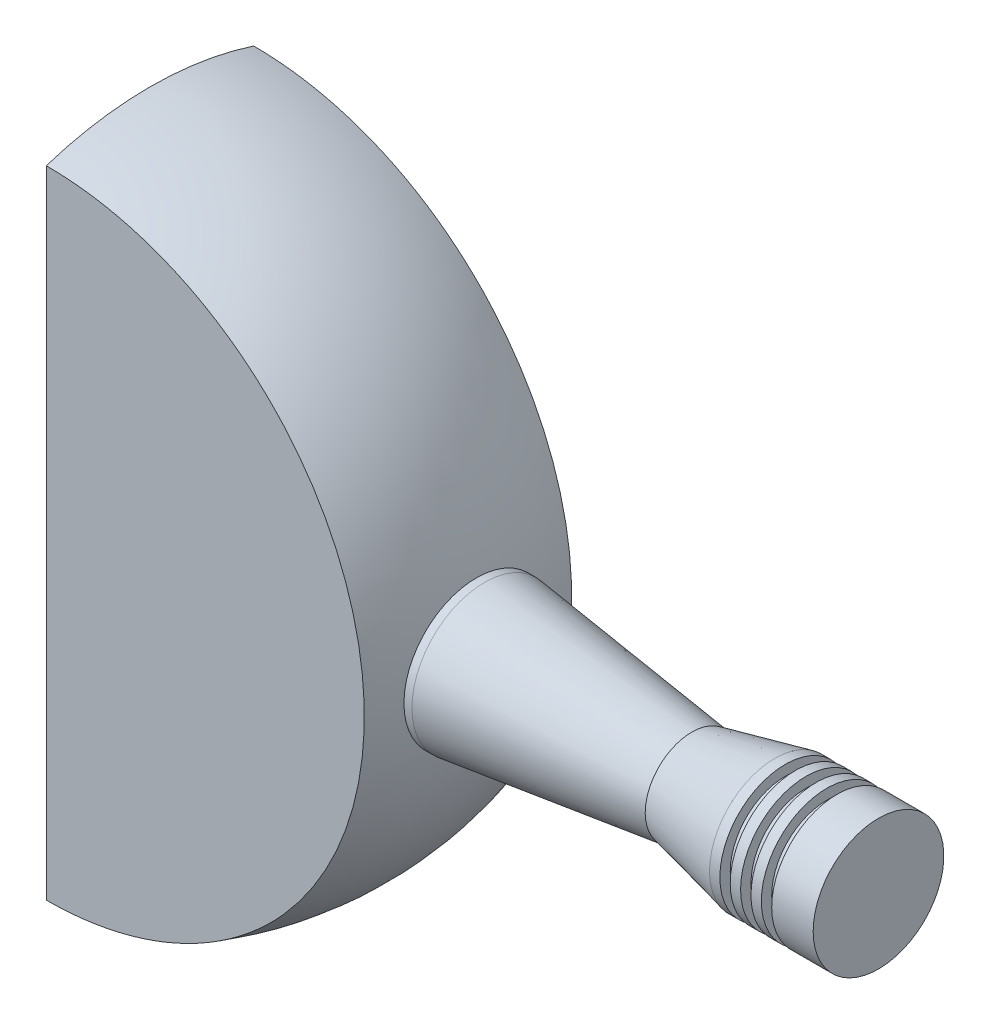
ISO-10303-21;
HEADER;
FILE_DESCRIPTION(('STEP AP214'),'2;1');
FILE_NAME('part.step','',(''),(''),'','','');
FILE_SCHEMA(('AUTOMOTIVE_DESIGN { 1 0 10303 214 1 1 1 1 }'));
ENDSEC;
DATA;
#1=APPLICATION_CONTEXT('core data for automotive mechanical design processes');
#2=APPLICATION_PROTOCOL_DEFINITION('international standard','automotive_design',2000,#1);
#3=PRODUCT_CONTEXT('',#1,'mechanical');
#4=PRODUCT('Part','Part','',(#3));
#5=PRODUCT_RELATED_PRODUCT_CATEGORY('part','',(#4));
#6=PRODUCT_DEFINITION_FORMATION('','',#4);
#7=PRODUCT_DEFINITION_CONTEXT('part definition',#1,'design');
#8=PRODUCT_DEFINITION('design','',#6,#7);
#9=PRODUCT_DEFINITION_SHAPE('','',#8);
#10=(LENGTH_UNIT() NAMED_UNIT(*) SI_UNIT(.MILLI.,.METRE.));
#11=(NAMED_UNIT(*) PLANE_ANGLE_UNIT() SI_UNIT($,.RADIAN.));
#12=(NAMED_UNIT(*) SI_UNIT($,.STERADIAN.) SOLID_ANGLE_UNIT());
#13=UNCERTAINTY_MEASURE_WITH_UNIT(LENGTH_MEASURE(1.E-05),#10,'distance_accuracy_value','');
#14=(GEOMETRIC_REPRESENTATION_CONTEXT(3) GLOBAL_UNCERTAINTY_ASSIGNED_CONTEXT((#13)) GLOBAL_UNIT_ASSIGNED_CONTEXT((#10,
#11,#12)) REPRESENTATION_CONTEXT('',''));
#15=CARTESIAN_POINT('',(0.,0.,0.));
#16=DIRECTION('',(0.,0.,1.));
#17=DIRECTION('',(1.,0.,0.));
#18=AXIS2_PLACEMENT_3D('',#15,#16,#17);
#19=CARTESIAN_POINT('',(0.,0.,0.));
#20=DIRECTION('',(0.,1.,0.));
#21=DIRECTION('',(1.,0.,0.));
#22=AXIS2_PLACEMENT_3D('',#19,#20,#21);
#23=SPHERICAL_SURFACE('',#22,16.13);
#24=CARTESIAN_POINT('',(15.7456946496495,0.,0.));
#25=DIRECTION('',(-1.,0.,0.));
#26=DIRECTION('',(0.,0.,1.));
#27=AXIS2_PLACEMENT_3D('',#24,#25,#26);
#28=CIRCLE('',#27,3.5);
#29=CARTESIAN_POINT('',(15.7456946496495,0.,3.5));
#30=VERTEX_POINT('',#29);
#31=EDGE_CURVE('E58',#30,#30,#28,.F.);
#32=ORIENTED_EDGE('',*,*,#31,.F.);
#33=EDGE_LOOP('',(#32));
#34=FACE_BOUND('',#33,.T.);
#35=CARTESIAN_POINT('',(0.,0.,5.));
#36=DIRECTION('',(0.,0.,1.));
#37=DIRECTION('',(0.,-1.,0.));
#38=AXIS2_PLACEMENT_3D('',#35,#36,#37);
#39=CIRCLE('',#38,15.3354784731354);
#40=CARTESIAN_POINT('',(0.,-15.3354784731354,5.));
#41=VERTEX_POINT('',#40);
#42=CARTESIAN_POINT('',(0.,15.3354784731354,5.));
#43=VERTEX_POINT('',#42);
#44=EDGE_CURVE('E48',#41,#43,#39,.T.);
#45=ORIENTED_EDGE('',*,*,#44,.F.);
#46=CARTESIAN_POINT('',(0.,0.,0.));
#47=DIRECTION('',(1.,0.,0.));
#48=DIRECTION('',(0.,0.,-1.));
#49=AXIS2_PLACEMENT_3D('',#46,#47,#48);
#50=CIRCLE('',#49,16.13);
#51=CARTESIAN_POINT('',(0.,-15.3354784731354,-5.00000000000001));
#52=VERTEX_POINT('',#51);
#53=EDGE_CURVE('E62',#41,#52,#50,.T.);
#54=ORIENTED_EDGE('',*,*,#53,.T.);
#55=CARTESIAN_POINT('',(0.,0.,-5.));
#56=DIRECTION('',(0.,0.,-1.));
#57=DIRECTION('',(0.,1.,0.));
#58=AXIS2_PLACEMENT_3D('',#55,#56,#57);
#59=CIRCLE('',#58,15.3354784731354);
#60=CARTESIAN_POINT('',(0.,15.3354784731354,-5.));
#61=VERTEX_POINT('',#60);
#62=EDGE_CURVE('E42',#61,#52,#59,.T.);
#63=ORIENTED_EDGE('',*,*,#62,.F.);
#64=EDGE_CURVE('E61',#61,#43,#50,.T.);
#65=ORIENTED_EDGE('',*,*,#64,.T.);
#66=EDGE_LOOP('',(#45,#54,#63,#65));
#67=FACE_BOUND('',#66,.T.);
#68=ADVANCED_FACE('F29',(#34,#67),#23,.T.);
#69=CARTESIAN_POINT('',(0.,16.13,69.844948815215));
#70=DIRECTION('',(1.,0.,0.));
#71=DIRECTION('',(0.,0.,-1.));
#72=AXIS2_PLACEMENT_3D('',#69,#70,#71);
#73=PLANE('',#72);
#74=DIRECTION('',(0.,-1.,0.));
#75=VECTOR('',#74,1.);
#76=CARTESIAN_POINT('',(0.,16.13,5.));
#77=LINE('',#76,#75);
#78=EDGE_CURVE('E12',#43,#41,#77,.T.);
#79=ORIENTED_EDGE('',*,*,#78,.F.);
#80=ORIENTED_EDGE('',*,*,#64,.F.);
#81=DIRECTION('',(0.,1.,0.));
#82=VECTOR('',#81,1.);
#83=CARTESIAN_POINT('',(0.,16.13,-5.));
#84=LINE('',#83,#82);
#85=EDGE_CURVE('E36',#52,#61,#84,.T.);
#86=ORIENTED_EDGE('',*,*,#85,.F.);
#87=ORIENTED_EDGE('',*,*,#53,.F.);
#88=EDGE_LOOP('',(#79,#80,#86,#87));
#89=FACE_BOUND('',#88,.T.);
#90=ADVANCED_FACE('F64',(#89),#73,.F.);
#91=CARTESIAN_POINT('',(0.,0.,0.));
#92=DIRECTION('',(-1.,0.,0.));
#93=DIRECTION('',(0.,0.,1.));
#94=AXIS2_PLACEMENT_3D('',#91,#92,#93);
#95=CYLINDRICAL_SURFACE('',#94,3.5);
#96=CARTESIAN_POINT('',(16.13,0.,0.));
#97=DIRECTION('',(-1.,0.,0.));
#98=DIRECTION('',(0.,0.,1.));
#99=AXIS2_PLACEMENT_3D('',#96,#97,#98);
#100=CIRCLE('',#99,3.5);
#101=CARTESIAN_POINT('',(16.13,0.,3.5));
#102=VERTEX_POINT('',#101);
#103=EDGE_CURVE('E84',#102,#102,#100,.T.);
#104=ORIENTED_EDGE('',*,*,#103,.T.);
#105=EDGE_LOOP('',(#104));
#106=FACE_BOUND('',#105,.T.);
#107=ORIENTED_EDGE('',*,*,#31,.T.);
#108=EDGE_LOOP('',(#107));
#109=FACE_BOUND('',#108,.T.);
#110=ADVANCED_FACE('F125',(#106,#109),#95,.T.);
#111=CARTESIAN_POINT('',(0.,0.,0.));
#112=DIRECTION('',(-1.,0.,0.));
#113=DIRECTION('',(0.,0.,1.));
#114=AXIS2_PLACEMENT_3D('',#111,#112,#113);
#115=CYLINDRICAL_SURFACE('',#114,3.15);
#116=CARTESIAN_POINT('',(32.13,0.,0.));
#117=DIRECTION('',(-1.,0.,0.));
#118=DIRECTION('',(0.,0.,1.));
#119=AXIS2_PLACEMENT_3D('',#116,#117,#118);
#120=CIRCLE('',#119,3.15);
#121=CARTESIAN_POINT('',(32.13,0.,3.15));
#122=VERTEX_POINT('',#121);
#123=EDGE_CURVE('E114',#122,#122,#120,.T.);
#124=ORIENTED_EDGE('',*,*,#123,.F.);
#125=EDGE_LOOP('',(#124));
#126=FACE_BOUND('',#125,.T.);
#127=CARTESIAN_POINT('',(32.63,0.,0.));
#128=DIRECTION('',(-1.,0.,0.));
#129=DIRECTION('',(0.,0.,1.));
#130=AXIS2_PLACEMENT_3D('',#127,#128,#129);
#131=CIRCLE('',#130,3.15);
#132=CARTESIAN_POINT('',(32.63,0.,3.15));
#133=VERTEX_POINT('',#132);
#134=EDGE_CURVE('E68',#133,#133,#131,.T.);
#135=ORIENTED_EDGE('',*,*,#134,.T.);
#136=EDGE_LOOP('',(#135));
#137=FACE_BOUND('',#136,.T.);
#138=ADVANCED_FACE('F121',(#126,#137),#115,.T.);
#139=CARTESIAN_POINT('',(32.63,3.15,0.));
#140=DIRECTION('',(-1.,0.,0.));
#141=DIRECTION('',(0.,0.,1.));
#142=AXIS2_PLACEMENT_3D('',#139,#140,#141);
#143=PLANE('',#142);
#144=ORIENTED_EDGE('',*,*,#134,.F.);
#145=EDGE_LOOP('',(#144));
#146=FACE_BOUND('',#145,.T.);
#147=CARTESIAN_POINT('',(32.63,0.,0.));
#148=DIRECTION('',(-1.,0.,0.));
#149=DIRECTION('',(0.,0.,1.));
#150=AXIS2_PLACEMENT_3D('',#147,#148,#149);
#151=CIRCLE('',#150,2.65);
#152=CARTESIAN_POINT('',(32.63,0.,2.65));
#153=VERTEX_POINT('',#152);
#154=EDGE_CURVE('E72',#153,#153,#151,.T.);
#155=ORIENTED_EDGE('',*,*,#154,.T.);
#156=EDGE_LOOP('',(#155));
#157=FACE_BOUND('',#156,.T.);
#158=ADVANCED_FACE('F124',(#146,#157),#143,.F.);
#159=CARTESIAN_POINT('',(0.,0.,0.));
#160=DIRECTION('',(-1.,0.,0.));
#161=DIRECTION('',(0.,0.,1.));
#162=AXIS2_PLACEMENT_3D('',#159,#160,#161);
#163=CYLINDRICAL_SURFACE('',#162,2.65);
#164=ORIENTED_EDGE('',*,*,#154,.F.);
#165=EDGE_LOOP('',(#164));
#166=FACE_BOUND('',#165,.T.);
#167=CARTESIAN_POINT('',(33.13,0.,0.));
#168=DIRECTION('',(-1.,0.,0.));
#169=DIRECTION('',(0.,0.,1.));
#170=AXIS2_PLACEMENT_3D('',#167,#168,#169);
#171=CIRCLE('',#170,2.65);
#172=CARTESIAN_POINT('',(33.13,0.,2.65));
#173=VERTEX_POINT('',#172);
#174=EDGE_CURVE('E75',#173,#173,#171,.T.);
#175=ORIENTED_EDGE('',*,*,#174,.T.);
#176=EDGE_LOOP('',(#175));
#177=FACE_BOUND('',#176,.T.);
#178=ADVANCED_FACE('F131',(#166,#177),#163,.T.);
#179=CARTESIAN_POINT('',(33.13,3.15,0.));
#180=DIRECTION('',(1.,0.,0.));
#181=DIRECTION('',(0.,0.,-1.));
#182=AXIS2_PLACEMENT_3D('',#179,#180,#181);
#183=PLANE('',#182);
#184=ORIENTED_EDGE('',*,*,#174,.F.);
#185=EDGE_LOOP('',(#184));
#186=FACE_BOUND('',#185,.T.);
#187=CARTESIAN_POINT('',(33.13,0.,0.));
#188=DIRECTION('',(-1.,0.,0.));
#189=DIRECTION('',(0.,0.,1.));
#190=AXIS2_PLACEMENT_3D('',#187,#188,#189);
#191=CIRCLE('',#190,3.15);
#192=CARTESIAN_POINT('',(33.13,0.,3.15));
#193=VERTEX_POINT('',#192);
#194=EDGE_CURVE('E78',#193,#193,#191,.T.);
#195=ORIENTED_EDGE('',*,*,#194,.T.);
#196=EDGE_LOOP('',(#195));
#197=FACE_BOUND('',#196,.T.);
#198=ADVANCED_FACE('F137',(#186,#197),#183,.F.);
#199=CARTESIAN_POINT('',(0.,0.,0.));
#200=DIRECTION('',(-1.,0.,0.));
#201=DIRECTION('',(0.,0.,1.));
#202=AXIS2_PLACEMENT_3D('',#199,#200,#201);
#203=CYLINDRICAL_SURFACE('',#202,3.15);
#204=ORIENTED_EDGE('',*,*,#194,.F.);
#205=EDGE_LOOP('',(#204));
#206=FACE_BOUND('',#205,.T.);
#207=CARTESIAN_POINT('',(35.13,0.,0.));
#208=DIRECTION('',(-1.,0.,0.));
#209=DIRECTION('',(0.,0.,1.));
#210=AXIS2_PLACEMENT_3D('',#207,#208,#209);
#211=CIRCLE('',#210,3.15);
#212=CARTESIAN_POINT('',(35.13,0.,3.15));
#213=VERTEX_POINT('',#212);
#214=EDGE_CURVE('E81',#213,#213,#211,.T.);
#215=ORIENTED_EDGE('',*,*,#214,.T.);
#216=EDGE_LOOP('',(#215));
#217=FACE_BOUND('',#216,.T.);
#218=ADVANCED_FACE('F143',(#206,#217),#203,.T.);
#219=CARTESIAN_POINT('',(35.13,3.15,0.));
#220=DIRECTION('',(-1.,0.,0.));
#221=DIRECTION('',(0.,0.,1.));
#222=AXIS2_PLACEMENT_3D('',#219,#220,#221);
#223=PLANE('',#222);
#224=ORIENTED_EDGE('',*,*,#214,.F.);
#225=EDGE_LOOP('',(#224));
#226=FACE_BOUND('',#225,.T.);
#227=ADVANCED_FACE('F149',(#226),#223,.F.);
#228=CARTESIAN_POINT('',(26.13,0.,0.));
#229=DIRECTION('',(-1.,0.,0.));
#230=DIRECTION('',(0.,0.,1.));
#231=AXIS2_PLACEMENT_3D('',#228,#229,#230);
#232=CONICAL_SURFACE('',#231,2.25,0.124354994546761);
#233=ORIENTED_EDGE('',*,*,#103,.F.);
#234=EDGE_LOOP('',(#233));
#235=FACE_BOUND('',#234,.T.);
#236=CARTESIAN_POINT('',(26.13,0.,0.));
#237=DIRECTION('',(-1.,0.,0.));
#238=DIRECTION('',(0.,0.,1.));
#239=AXIS2_PLACEMENT_3D('',#236,#237,#238);
#240=CIRCLE('',#239,2.25);
#241=CARTESIAN_POINT('',(26.13,0.,2.25));
#242=VERTEX_POINT('',#241);
#243=EDGE_CURVE('E87',#242,#242,#240,.T.);
#244=ORIENTED_EDGE('',*,*,#243,.T.);
#245=EDGE_LOOP('',(#244));
#246=FACE_BOUND('',#245,.T.);
#247=ADVANCED_FACE('F154',(#235,#246),#232,.T.);
#248=CARTESIAN_POINT('',(30.13,0.,0.));
#249=DIRECTION('',(1.,0.,0.));
#250=DIRECTION('',(0.,0.,-1.));
#251=AXIS2_PLACEMENT_3D('',#248,#249,#250);
#252=CONICAL_SURFACE('',#251,3.15,0.221314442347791);
#253=ORIENTED_EDGE('',*,*,#243,.F.);
#254=EDGE_LOOP('',(#253));
#255=FACE_BOUND('',#254,.T.);
#256=CARTESIAN_POINT('',(30.13,0.,0.));
#257=DIRECTION('',(-1.,0.,0.));
#258=DIRECTION('',(0.,0.,1.));
#259=AXIS2_PLACEMENT_3D('',#256,#257,#258);
#260=CIRCLE('',#259,3.15);
#261=CARTESIAN_POINT('',(30.13,0.,3.15));
#262=VERTEX_POINT('',#261);
#263=EDGE_CURVE('E90',#262,#262,#260,.T.);
#264=ORIENTED_EDGE('',*,*,#263,.T.);
#265=EDGE_LOOP('',(#264));
#266=FACE_BOUND('',#265,.T.);
#267=ADVANCED_FACE('F159',(#255,#266),#252,.T.);
#268=CARTESIAN_POINT('',(0.,0.,0.));
#269=DIRECTION('',(-1.,0.,0.));
#270=DIRECTION('',(0.,0.,1.));
#271=AXIS2_PLACEMENT_3D('',#268,#269,#270);
#272=CYLINDRICAL_SURFACE('',#271,3.15);
#273=ORIENTED_EDGE('',*,*,#263,.F.);
#274=EDGE_LOOP('',(#273));
#275=FACE_BOUND('',#274,.T.);
#276=CARTESIAN_POINT('',(30.63,0.,0.));
#277=DIRECTION('',(-1.,0.,0.));
#278=DIRECTION('',(0.,0.,1.));
#279=AXIS2_PLACEMENT_3D('',#276,#277,#278);
#280=CIRCLE('',#279,3.15);
#281=CARTESIAN_POINT('',(30.63,0.,3.15));
#282=VERTEX_POINT('',#281);
#283=EDGE_CURVE('E93',#282,#282,#280,.T.);
#284=ORIENTED_EDGE('',*,*,#283,.T.);
#285=EDGE_LOOP('',(#284));
#286=FACE_BOUND('',#285,.T.);
#287=ADVANCED_FACE('F178',(#275,#286),#272,.T.);
#288=CARTESIAN_POINT('',(30.63,3.15,0.));
#289=DIRECTION('',(-1.,0.,0.));
#290=DIRECTION('',(0.,0.,1.));
#291=AXIS2_PLACEMENT_3D('',#288,#289,#290);
#292=PLANE('',#291);
#293=ORIENTED_EDGE('',*,*,#283,.F.);
#294=EDGE_LOOP('',(#293));
#295=FACE_BOUND('',#294,.T.);
#296=CARTESIAN_POINT('',(30.63,0.,0.));
#297=DIRECTION('',(-1.,0.,0.));
#298=DIRECTION('',(0.,0.,1.));
#299=AXIS2_PLACEMENT_3D('',#296,#297,#298);
#300=CIRCLE('',#299,2.65);
#301=CARTESIAN_POINT('',(30.63,0.,2.65));
#302=VERTEX_POINT('',#301);
#303=EDGE_CURVE('E96',#302,#302,#300,.T.);
#304=ORIENTED_EDGE('',*,*,#303,.T.);
#305=EDGE_LOOP('',(#304));
#306=FACE_BOUND('',#305,.T.);
#307=ADVANCED_FACE('F182',(#295,#306),#292,.F.);
#308=CARTESIAN_POINT('',(0.,0.,0.));
#309=DIRECTION('',(-1.,0.,0.));
#310=DIRECTION('',(0.,0.,1.));
#311=AXIS2_PLACEMENT_3D('',#308,#309,#310);
#312=CYLINDRICAL_SURFACE('',#311,2.65);
#313=ORIENTED_EDGE('',*,*,#303,.F.);
#314=EDGE_LOOP('',(#313));
#315=FACE_BOUND('',#314,.T.);
#316=CARTESIAN_POINT('',(31.13,0.,0.));
#317=DIRECTION('',(-1.,0.,0.));
#318=DIRECTION('',(0.,0.,1.));
#319=AXIS2_PLACEMENT_3D('',#316,#317,#318);
#320=CIRCLE('',#319,2.65);
#321=CARTESIAN_POINT('',(31.13,0.,2.65));
#322=VERTEX_POINT('',#321);
#323=EDGE_CURVE('E99',#322,#322,#320,.T.);
#324=ORIENTED_EDGE('',*,*,#323,.T.);
#325=EDGE_LOOP('',(#324));
#326=FACE_BOUND('',#325,.T.);
#327=ADVANCED_FACE('F186',(#315,#326),#312,.T.);
#328=CARTESIAN_POINT('',(31.13,3.15,0.));
#329=DIRECTION('',(1.,0.,0.));
#330=DIRECTION('',(0.,0.,-1.));
#331=AXIS2_PLACEMENT_3D('',#328,#329,#330);
#332=PLANE('',#331);
#333=ORIENTED_EDGE('',*,*,#323,.F.);
#334=EDGE_LOOP('',(#333));
#335=FACE_BOUND('',#334,.T.);
#336=CARTESIAN_POINT('',(31.13,0.,0.));
#337=DIRECTION('',(-1.,0.,0.));
#338=DIRECTION('',(0.,0.,1.));
#339=AXIS2_PLACEMENT_3D('',#336,#337,#338);
#340=CIRCLE('',#339,3.15);
#341=CARTESIAN_POINT('',(31.13,0.,3.15));
#342=VERTEX_POINT('',#341);
#343=EDGE_CURVE('E102',#342,#342,#340,.T.);
#344=ORIENTED_EDGE('',*,*,#343,.T.);
#345=EDGE_LOOP('',(#344));
#346=FACE_BOUND('',#345,.T.);
#347=ADVANCED_FACE('F190',(#335,#346),#332,.F.);
#348=CARTESIAN_POINT('',(0.,0.,0.));
#349=DIRECTION('',(-1.,0.,0.));
#350=DIRECTION('',(0.,0.,1.));
#351=AXIS2_PLACEMENT_3D('',#348,#349,#350);
#352=CYLINDRICAL_SURFACE('',#351,3.15);
#353=ORIENTED_EDGE('',*,*,#343,.F.);
#354=EDGE_LOOP('',(#353));
#355=FACE_BOUND('',#354,.T.);
#356=CARTESIAN_POINT('',(31.63,0.,0.));
#357=DIRECTION('',(-1.,0.,0.));
#358=DIRECTION('',(0.,0.,1.));
#359=AXIS2_PLACEMENT_3D('',#356,#357,#358);
#360=CIRCLE('',#359,3.15);
#361=CARTESIAN_POINT('',(31.63,0.,3.15));
#362=VERTEX_POINT('',#361);
#363=EDGE_CURVE('E105',#362,#362,#360,.T.);
#364=ORIENTED_EDGE('',*,*,#363,.T.);
#365=EDGE_LOOP('',(#364));
#366=FACE_BOUND('',#365,.T.);
#367=ADVANCED_FACE('F194',(#355,#366),#352,.T.);
#368=CARTESIAN_POINT('',(31.63,3.15,0.));
#369=DIRECTION('',(-1.,0.,0.));
#370=DIRECTION('',(0.,0.,1.));
#371=AXIS2_PLACEMENT_3D('',#368,#369,#370);
#372=PLANE('',#371);
#373=ORIENTED_EDGE('',*,*,#363,.F.);
#374=EDGE_LOOP('',(#373));
#375=FACE_BOUND('',#374,.T.);
#376=CARTESIAN_POINT('',(31.63,0.,0.));
#377=DIRECTION('',(-1.,0.,0.));
#378=DIRECTION('',(0.,0.,1.));
#379=AXIS2_PLACEMENT_3D('',#376,#377,#378);
#380=CIRCLE('',#379,2.65);
#381=CARTESIAN_POINT('',(31.63,0.,2.65));
#382=VERTEX_POINT('',#381);
#383=EDGE_CURVE('E108',#382,#382,#380,.T.);
#384=ORIENTED_EDGE('',*,*,#383,.T.);
#385=EDGE_LOOP('',(#384));
#386=FACE_BOUND('',#385,.T.);
#387=ADVANCED_FACE('F198',(#375,#386),#372,.F.);
#388=CARTESIAN_POINT('',(0.,0.,0.));
#389=DIRECTION('',(-1.,0.,0.));
#390=DIRECTION('',(0.,0.,1.));
#391=AXIS2_PLACEMENT_3D('',#388,#389,#390);
#392=CYLINDRICAL_SURFACE('',#391,2.65);
#393=ORIENTED_EDGE('',*,*,#383,.F.);
#394=EDGE_LOOP('',(#393));
#395=FACE_BOUND('',#394,.T.);
#396=CARTESIAN_POINT('',(32.13,0.,0.));
#397=DIRECTION('',(-1.,0.,0.));
#398=DIRECTION('',(0.,0.,1.));
#399=AXIS2_PLACEMENT_3D('',#396,#397,#398);
#400=CIRCLE('',#399,2.65);
#401=CARTESIAN_POINT('',(32.13,0.,2.65));
#402=VERTEX_POINT('',#401);
#403=EDGE_CURVE('E111',#402,#402,#400,.T.);
#404=ORIENTED_EDGE('',*,*,#403,.T.);
#405=EDGE_LOOP('',(#404));
#406=FACE_BOUND('',#405,.T.);
#407=ADVANCED_FACE('F202',(#395,#406),#392,.T.);
#408=CARTESIAN_POINT('',(32.13,3.15,0.));
#409=DIRECTION('',(1.,0.,0.));
#410=DIRECTION('',(0.,0.,-1.));
#411=AXIS2_PLACEMENT_3D('',#408,#409,#410);
#412=PLANE('',#411);
#413=ORIENTED_EDGE('',*,*,#403,.F.);
#414=EDGE_LOOP('',(#413));
#415=FACE_BOUND('',#414,.T.);
#416=ORIENTED_EDGE('',*,*,#123,.T.);
#417=EDGE_LOOP('',(#416));
#418=FACE_BOUND('',#417,.T.);
#419=ADVANCED_FACE('F119',(#415,#418),#412,.F.);
#420=CARTESIAN_POINT('',(-40.,17.1185351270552,-5.));
#421=DIRECTION('',(0.,0.,-1.));
#422=DIRECTION('',(0.,1.,0.));
#423=AXIS2_PLACEMENT_3D('',#420,#421,#422);
#424=PLANE('',#423);
#425=ORIENTED_EDGE('',*,*,#62,.T.);
#426=ORIENTED_EDGE('',*,*,#85,.T.);
#427=EDGE_LOOP('',(#425,#426));
#428=FACE_BOUND('',#427,.T.);
#429=ADVANCED_FACE('F53',(#428),#424,.T.);
#430=CARTESIAN_POINT('',(-40.,17.1185351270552,5.));
#431=DIRECTION('',(0.,0.,1.));
#432=DIRECTION('',(0.,-1.,0.));
#433=AXIS2_PLACEMENT_3D('',#430,#431,#432);
#434=PLANE('',#433);
#435=ORIENTED_EDGE('',*,*,#44,.T.);
#436=ORIENTED_EDGE('',*,*,#78,.T.);
#437=EDGE_LOOP('',(#435,#436));
#438=FACE_BOUND('',#437,.T.);
#439=ADVANCED_FACE('F209',(#438),#434,.T.);
#440=CLOSED_SHELL('',(#68,#90,#110,#138,#158,#178,#198,#218,#227,#247,#267,#287,#307,#327,#347,
#367,#387,#407,#419,#429,#439));
#441=MANIFOLD_SOLID_BREP('B2',#440);
#442=ADVANCED_BREP_SHAPE_REPRESENTATION('',(#18,#441),#14);
#443=SHAPE_DEFINITION_REPRESENTATION(#9,#442);
ENDSEC;
END-ISO-10303-21;
